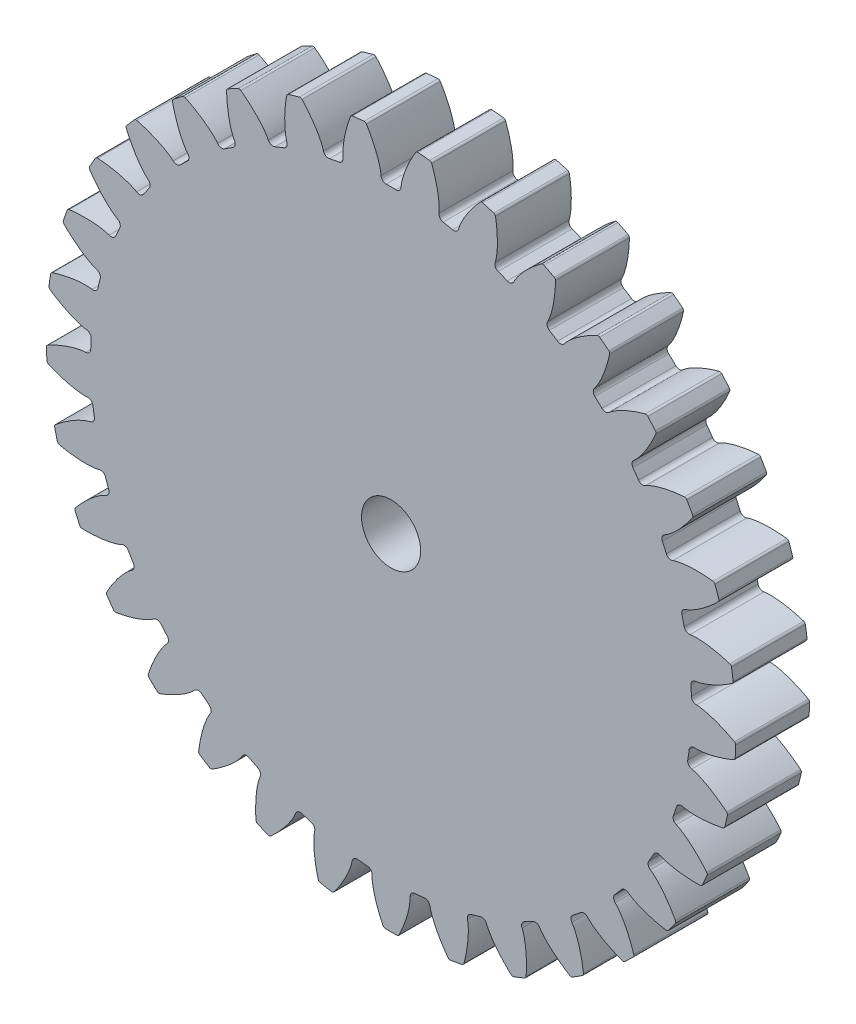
from build123d import *

# Parameters (mm, degrees)
SKETCH1_R                            = 29.633333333
BOSS_EXTRUDE1_DEPTH                  = 6.35
CUT_EXTRUDE_DCGTBC_DEPTH             = 43.386216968
FILLET_DCGTBC_R                      = 0.215886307
CIRPATTERN_DCGTBC_COUNT              = 33
FILLET_DCGTBC_OF_CIRPATTERN_DCGTBC_R = 0.215886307
SKETCH4_R                            = 2.54
CUT_EXTRUDE2_DEPTH                   = 43.376489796


with BuildPart() as part:
    # Sketch1 → Boss-Extrude1 (new body)
    with BuildSketch(Plane.XY):
        Circle(SKETCH1_R)
    extrude(amount=BOSS_EXTRUDE1_DEPTH)

    # DCGTBC → Cut-Extrude-DCGTBC (cut, through all)
    with BuildSketch(Plane.XY):
        with BuildLine():
            add(Edge.make_bspline(
                [(0.858085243, 26.236373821), (0.858314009, 26.242839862), (0.859148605, 26.2588856), (0.861513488, 26.288160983), (0.866403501, 26.335149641), (0.873983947, 26.393481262), (0.885505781, 26.468771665), (0.90129548, 26.557317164), (0.920969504, 26.654454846), (0.944878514, 26.759933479), (0.970944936, 26.864969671), (0.999007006, 26.969553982), (1.028818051, 27.07355156), (1.067121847, 27.199292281), (1.116099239, 27.349732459), (1.177782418, 27.525046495), (1.252972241, 27.723226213), (1.335191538, 27.924456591), (1.420684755, 28.121834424), (1.512333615, 28.32048158), (1.604741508, 28.51212968), (1.706112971, 28.710341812), (1.802424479, 28.892871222), (1.916280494, 29.096374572), (2.009901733, 29.260316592), (2.111568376, 29.428802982), (2.161781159, 29.510677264), (2.187750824, 29.552465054)],
                knots=[-0.001165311, -0.001165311, -0.001165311, -0.001165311, -0.001165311, 0.005376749, 0.015083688, 0.02853182, 0.04661014, 0.064854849, 0.092110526, 0.119476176, 0.146842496, 0.174208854, 0.201574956, 0.228941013, 0.256307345, 0.307035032, 0.361767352, 0.416499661, 0.471231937, 0.525964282, 0.580696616, 0.635428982, 0.690161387, 0.744893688, 0.799626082, 0.854358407, 0.909090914, 0.909090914, 0.909090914, 0.909090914, 0.909090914], degree=4))
            ThreePointArc((2.187750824, 29.552465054), (0, 29.633333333), (-2.187750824, 29.552465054))
            add(Edge.make_bspline(
                [(-0.858085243, 26.236373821), (-0.858314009, 26.242839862), (-0.859148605, 26.2588856), (-0.861513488, 26.288160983), (-0.866403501, 26.335149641), (-0.873983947, 26.393481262), (-0.885505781, 26.468771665), (-0.90129548, 26.557317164), (-0.920969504, 26.654454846), (-0.944878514, 26.759933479), (-0.970944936, 26.864969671), (-0.999007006, 26.969553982), (-1.028818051, 27.07355156), (-1.067121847, 27.199292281), (-1.116099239, 27.349732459), (-1.177782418, 27.525046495), (-1.252972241, 27.723226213), (-1.335191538, 27.924456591), (-1.420684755, 28.121834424), (-1.512333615, 28.32048158), (-1.604741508, 28.51212968), (-1.706112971, 28.710341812), (-1.802424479, 28.892871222), (-1.916280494, 29.096374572), (-2.009901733, 29.260316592), (-2.111568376, 29.428802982), (-2.161781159, 29.510677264), (-2.187750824, 29.552465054)],
                knots=[-0.001165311, -0.001165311, -0.001165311, -0.001165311, -0.001165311, 0.005376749, 0.015083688, 0.02853182, 0.04661014, 0.064854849, 0.092110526, 0.119476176, 0.146842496, 0.174208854, 0.201574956, 0.228941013, 0.256307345, 0.307035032, 0.361767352, 0.416499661, 0.471231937, 0.525964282, 0.580696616, 0.635428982, 0.690161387, 0.744893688, 0.799626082, 0.854358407, 0.909090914, 0.909090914, 0.909090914, 0.909090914, 0.909090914], degree=4))
            ThreePointArc((-0.858085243, 26.236373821), (-0.723912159, 25.938554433), (-0.419567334, 25.819924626))
            ThreePointArc((-0.419567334, 25.819924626), (0, 25.823333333), (0.419567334, 25.819924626))
            ThreePointArc((0.419567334, 25.819924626), (0.723912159, 25.938554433), (0.858085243, 26.236373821))
        make_face()
    cut_extrude_dcgtbc = extrude(amount=CUT_EXTRUDE_DCGTBC_DEPTH, mode=Mode.SUBTRACT)

    # Fillet-DCGTBC
    fillet_dcgtbc_edges = [part.edges().sort_by_distance(p)[0] for p in [
        (2.187750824, 29.552465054, 3.175),
        (-2.187750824, 29.552465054, 3.175),
    ]]
    fillet(fillet_dcgtbc_edges, radius=FILLET_DCGTBC_R)

    # CirPattern-DCGTBC: Cut-Extrude-DCGTBC ×33 about axis
    cirpattern_dcgtbc_axis = Axis((0, 0, 6.35), (0, 0, 1))
    for i in range(1, CIRPATTERN_DCGTBC_COUNT):
        add(cut_extrude_dcgtbc.rotate(cirpattern_dcgtbc_axis, i * 360 / CIRPATTERN_DCGTBC_COUNT), mode=Mode.SUBTRACT)

    # Fillet-DCGTBC of CirPattern-DCGTBC
    fillet_dcgtbc_of_cirpattern_dcgtbc_edges = [part.edges().sort_by_distance(p)[0] for p in [
        (-3.444625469, 29.432448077, 3.175),
        (-7.741056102, 28.604378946, 3.175),
        (-8.952504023, 28.248665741, 3.175),
        (-13.014579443, 26.622456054, 3.175),
        (-14.136815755, 26.043903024, 3.175),
        (-17.817721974, 23.678328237, 3.175),
        (-18.810186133, 22.897845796, 3.175),
        (-21.97688561, 19.878403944, 3.175),
        (-22.803707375, 18.92420076, 3.175),
        (-25.341747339, 15.360022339, 3.175),
        (-25.973043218, 14.266585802, 3.175),
        (-27.790692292, 10.286489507, 3.175),
        (-28.203645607, 9.093339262, 3.175),
        (-29.235209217, 4.841176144, 3.175),
        (-29.414894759, 3.591435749, 3.175),
        (-29.62308951, -0.77910994, 3.175),
        (-29.563012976, -2.04027161, 3.175),
        (-28.940314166, -6.37123696, 3.175),
        (-28.642646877, -7.598238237, 3.175),
        (-27.211560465, -11.733090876, 3.175),
        (-26.687060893, -12.881584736, 3.175),
        (-24.499310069, -16.670880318, 3.175),
        (-23.766934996, -17.699357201, 3.175),
        (-20.901590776, -21.006140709, 3.175),
        (-19.987810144, -21.877428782, 3.175),
        (-16.548433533, -24.582184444, 3.175),
        (-15.486273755, -25.264793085, 3.175),
        (-11.597172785, -27.269763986, 3.175),
        (-10.425023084, -27.739021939, 3.175),
        (-6.226759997, -28.971743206, 3.175),
        (-4.986984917, -29.210690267, 3.175),
        (-0.631295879, -29.626608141, 3.175),
        (0.631295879, -29.626608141, 3.175),
        (4.986984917, -29.210690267, 3.175),
        (6.226759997, -28.971743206, 3.175),
        (10.425023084, -27.739021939, 3.175),
        (11.597172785, -27.269763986, 3.175),
        (15.486273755, -25.264793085, 3.175),
        (16.548433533, -24.582184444, 3.175),
        (19.987810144, -21.877428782, 3.175),
        (20.901590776, -21.006140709, 3.175),
        (23.766934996, -17.699357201, 3.175),
        (24.499310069, -16.670880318, 3.175),
        (26.687060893, -12.881584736, 3.175),
        (27.211560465, -11.733090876, 3.175),
        (28.642646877, -7.598238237, 3.175),
        (28.940314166, -6.37123696, 3.175),
        (29.563012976, -2.04027161, 3.175),
        (29.62308951, -0.77910994, 3.175),
        (29.414894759, 3.591435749, 3.175),
        (29.235209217, 4.841176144, 3.175),
        (28.203645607, 9.093339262, 3.175),
        (27.790692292, 10.286489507, 3.175),
        (25.973043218, 14.266585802, 3.175),
        (25.341747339, 15.360022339, 3.175),
        (22.803707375, 18.92420076, 3.175),
        (21.97688561, 19.878403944, 3.175),
        (18.810186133, 22.897845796, 3.175),
        (17.817721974, 23.678328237, 3.175),
        (14.136815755, 26.043903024, 3.175),
        (13.014579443, 26.622456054, 3.175),
        (8.952504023, 28.248665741, 3.175),
        (7.741056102, 28.604378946, 3.175),
        (3.444625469, 29.432448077, 3.175),
    ]]
    fillet(fillet_dcgtbc_of_cirpattern_dcgtbc_edges, radius=FILLET_DCGTBC_OF_CIRPATTERN_DCGTBC_R)

    # Sketch4 → Cut-Extrude2 (cut, through all)
    with BuildSketch(Plane.XY.offset(6.35)):
        Circle(SKETCH4_R)
    extrude(amount=-CUT_EXTRUDE2_DEPTH, mode=Mode.SUBTRACT)


solid = part.part
